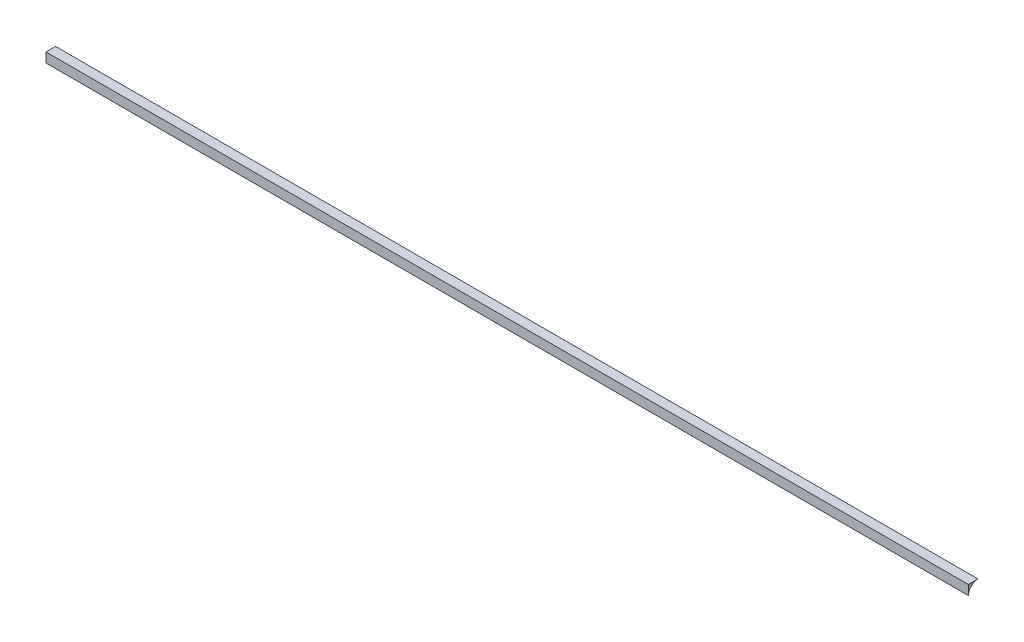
from build123d import *

# Parameters (mm, degrees)
APPLIED_CORNER_CAULK_DEPTH = 304.8


with BuildPart() as part:
    # Sketch1 → Applied_corner_caulk (new body)
    with BuildSketch(Plane.YZ):
        Polygon((152.4, 152.4), (149.225, 152.4), (149.844411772, 152.338993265), (150.440019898, 152.158317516), (150.98893549, 151.864916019), (151.47006403, 151.47006403), (151.864916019, 150.98893549), (152.158317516, 150.440019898), (152.338993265, 149.844411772), (152.4, 149.225), align=None)
    extrude(amount=APPLIED_CORNER_CAULK_DEPTH)


solid = part.part
